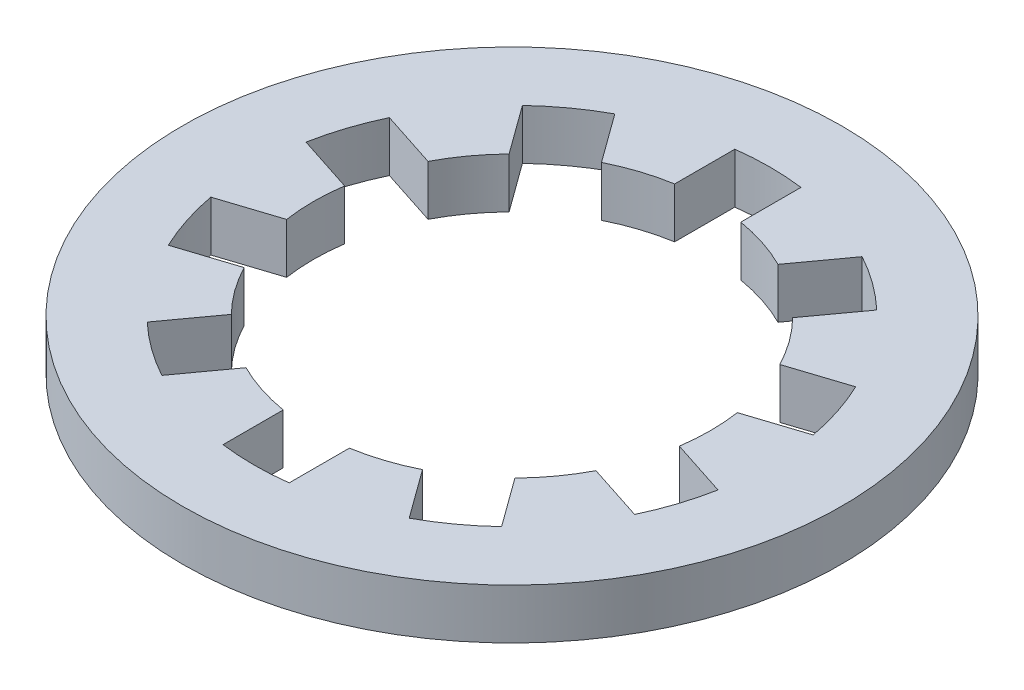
from build123d import *

# Parameters (mm, degrees)
SKETCH1_R          = 11.176
SKETCH1_R_2        = 6.731
EXTRUDE1_DEPTH     = 1.7018
CUT_EXTRUDE1_DEPTH = 16.896605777
CIRPATTERN1_COUNT  = 10


with BuildPart() as part:
    # Sketch1 → Extrude1 (new body)
    with BuildSketch(Plane(origin=(0, 0, 0), x_dir=(1, 0, 0), z_dir=(0, 1, 0))):
        with Locations(Location((0, 0, 0), (0, 0, 270))):
            Circle(SKETCH1_R)
        with Locations(Location((0, 0, 0), (0, 0, 270))):
            Circle(SKETCH1_R_2, mode=Mode.SUBTRACT)
    extrude(amount=EXTRUDE1_DEPTH)

    # Sketch2 → Cut-Extrude1 (cut, through all)
    with BuildSketch(Plane(origin=(0, 1.7018, 0), x_dir=(-1, 0, 0), z_dir=(0, 1, 0))):
        with BuildLine():
            Line((-1.121833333, 8.678089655), (-1.121833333, 6.636855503))
            ThreePointArc((-1.121833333, 6.636855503), (0, 6.731), (1.121833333, 6.636855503))
            Line((1.121833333, 6.636855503), (1.121833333, 8.678089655))
            ThreePointArc((1.121833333, 8.678089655), (0, 8.7503), (-1.121833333, 8.678089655))
        make_face()
    cut_extrude1 = extrude(amount=-CUT_EXTRUDE1_DEPTH, mode=Mode.SUBTRACT)

    # CirPattern1: Cut-Extrude1 ×10 about axis
    cirpattern1_axis = Axis((0, 0, 0), (0, 1, 0))
    for i in range(1, CIRPATTERN1_COUNT):
        add(cut_extrude1.rotate(cirpattern1_axis, i * 360 / CIRPATTERN1_COUNT), mode=Mode.SUBTRACT)


solid = part.part
